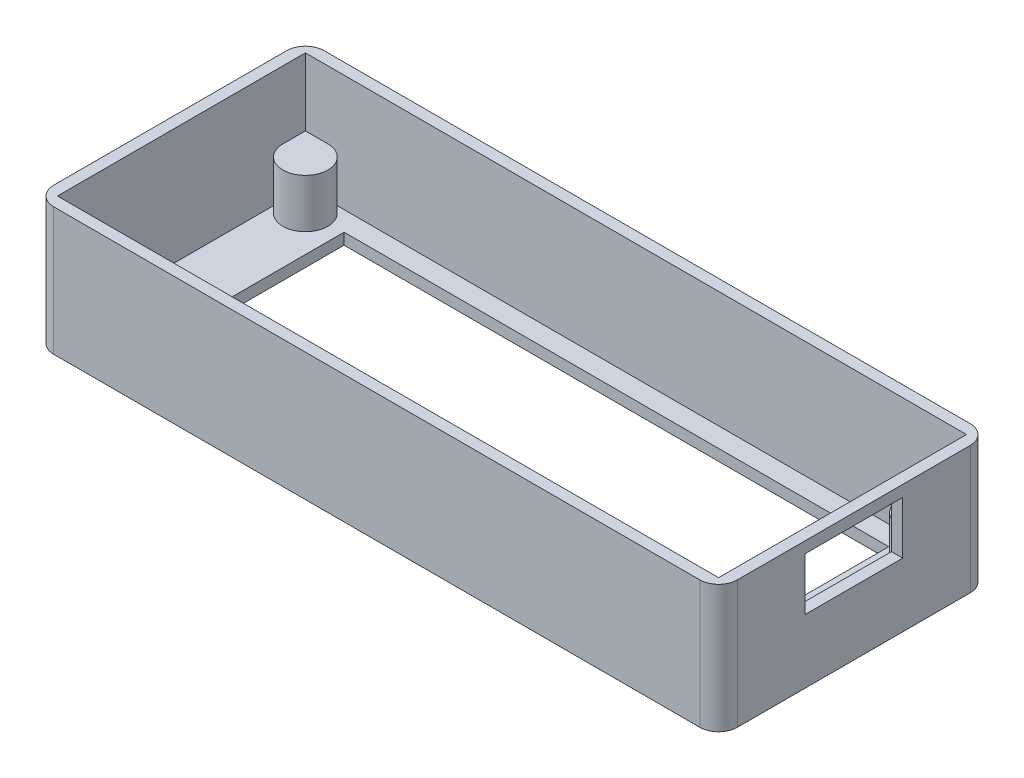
from build123d import *

# Parameters (mm, degrees)
SKETCH_1_W            = 91
SKETCH_1_H            = 36
EXTRUDE_1_DEPTH       = 17
SHELL_1_T             = -1.5
FILLET_1_R            = 2.5
CUT_EXTRUDE_1_REACH   = 53.327
SKETCH_2_W            = 72.5
SKETCH_2_H            = 27.8
EXTRUDE_2_DEPTH       = 6.5
MIRROR_2_COPY_1_DEPTH = 6.5
CUT_EXTRUDE_2_REACH   = 96.308
SKETCH_4_W            = 13
SKETCH_4_H            = 7


with BuildPart() as part:
    # Sketch 1 → Extrude 1 (new body)
    with BuildSketch(Plane(origin=(0, 0, 0), x_dir=(1, 0, 0), z_dir=(0, 1, 0))):
        Rectangle(SKETCH_1_W, SKETCH_1_H)
    extrude(amount=EXTRUDE_1_DEPTH)

    # Shell 1
    shell_1_openings = [part.faces().sort_by_distance(p)[0] for p in [
        (0, 17, 0),
    ]]
    offset(amount=SHELL_1_T, openings=shell_1_openings, kind=Kind.INTERSECTION)

    # Fillet 1
    fillet_1_edges = [part.edges().sort_by_distance(p)[0] for p in [
        (45.5, 8.5, 18),
        (-45.5, 8.5, 18),
        (-45.5, 8.5, -18),
        (45.5, 8.5, -18),
    ]]
    fillet(fillet_1_edges, radius=FILLET_1_R)

    # Sketch 2 → Cut-Extrude 1 (cut, up to next)
    with BuildSketch(Plane(origin=(0, 1.5, 0), x_dir=(1, 0, 0), z_dir=(0, 1, 0)), mode=Mode.PRIVATE) as cut_extrude_1_sk1:
        Rectangle(SKETCH_2_W, SKETCH_2_H)
    cut_extrude_1_tool1 = extrude(cut_extrude_1_sk1.sketch, amount=-CUT_EXTRUDE_1_REACH, mode=Mode.PRIVATE) & part.part
    add(cut_extrude_1_tool1.solids().sort_by_distance((0, 1.5, 0))[0], mode=Mode.SUBTRACT)

    # Sketch 3 → Extrude 2 (add)
    with BuildSketch(Plane(origin=(0, 1.5, 0), x_dir=(1, 0, 0), z_dir=(0, 1, 0))):
        with BuildLine():
            Line((-44, 16.5), (-41, 16.5))
            ThreePointArc((-41, 16.5), (-38.878679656, 11.378679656), (-44, 13.5))
            Line((-44, 13.5), (-44, 16.5))
        make_face()
    extrude_2 = extrude(amount=EXTRUDE_2_DEPTH)

    # Mirror 1: Extrude 2 across plane
    add(extrude_2.mirror(Plane(origin=(0, 0, 0), x_dir=(0, 0, 1), z_dir=(1, 0, 0))))

    # Mirror 2: Extrude 2 across plane
    add(extrude_2.mirror(Plane.XY))

    # Mirror 2 copy 1 sketch → Mirror 2 copy 1 (add)
    with BuildSketch(Plane(origin=(0, 1.5, 0), x_dir=(-1, 0, 0), z_dir=(0, 1, 0))):
        with BuildLine():
            Line((-44, 16.5), (-41, 16.5))
            ThreePointArc((-41, 16.5), (-38.878679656, 11.378679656), (-44, 13.5))
            Line((-44, 13.5), (-44, 16.5))
        make_face()
    extrude(amount=MIRROR_2_COPY_1_DEPTH)

    # Sketch 4 → Cut-Extrude 2 (cut, up to next)
    with BuildSketch(Plane(origin=(45.5, 0, 0), x_dir=(0, 0, -1), z_dir=(1, 0, 0)), mode=Mode.PRIVATE) as cut_extrude_2_sk1:
        with Locations((0, 12)):
            Rectangle(SKETCH_4_W, SKETCH_4_H)
    cut_extrude_2_tool1 = extrude(cut_extrude_2_sk1.sketch, amount=-CUT_EXTRUDE_2_REACH, mode=Mode.PRIVATE) & part.part
    add(cut_extrude_2_tool1.solids().sort_by_distance((45.5, 12, 0))[0], mode=Mode.SUBTRACT)


solid = part.part
